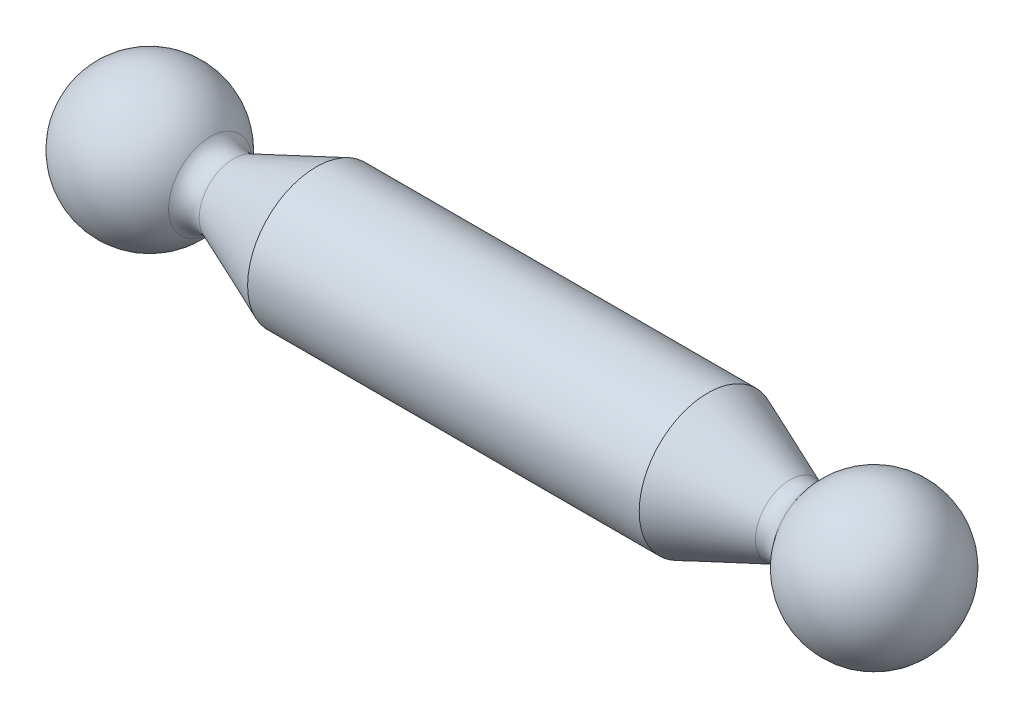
from build123d import *


with BuildPart() as part:
    # Esquisse1 → R_volution2 (revolve)
    with BuildSketch(Plane(origin=(0, 0, 0), x_dir=(1, 0, 0), z_dir=(0, 1, 0)), mode=Mode.PRIVATE) as r_volution2_sk:
        with BuildLine():
            Line((17, 7), (57, 7))
            Line((57, 7), (65.412433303, 3.536056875))
            ThreePointArc((65.412433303, 3.536056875), (66.743411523, 3.468203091), (67.821525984, 4.251641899))
            ThreePointArc((67.821525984, 4.251641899), (76.226145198, 7.162002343), (81.5, 0))
            Line((81.5, 0), (-7.5, 0))
            ThreePointArc((-7.5, 0), (-2.226145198, 7.162002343), (6.178474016, 4.251641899))
            ThreePointArc((6.178474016, 4.251641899), (7.256588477, 3.468203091), (8.587566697, 3.536056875))
            Line((8.587566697, 3.536056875), (17, 7))
        make_face()
    revolve(r_volution2_sk.sketch.rotate(Axis((-7.5, 0, 0), (1, 0, 0)), 180), axis=Axis((-7.5, 0, 0), (1, 0, 0)))


solid = part.part
